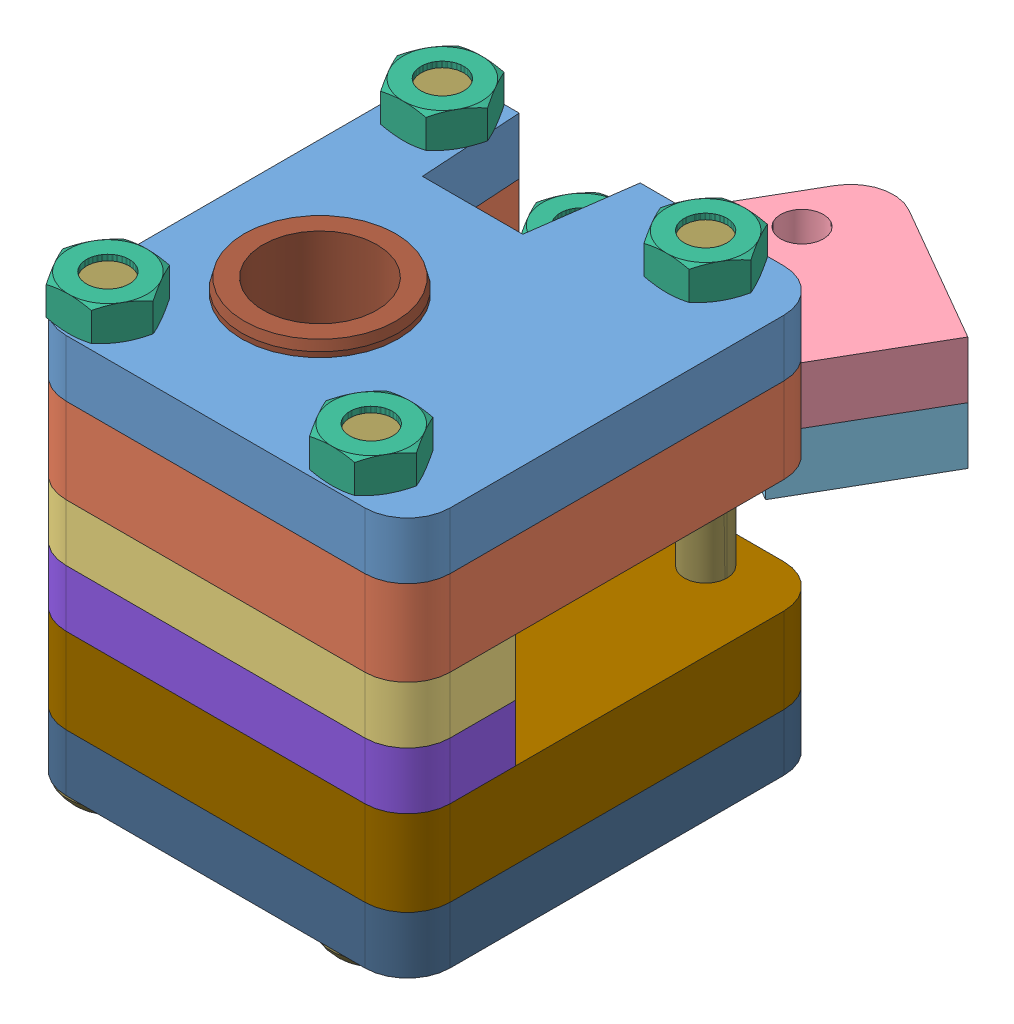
SolidWorks assembly UM_3050_ASM.sldasm, configuration Default (file format 5000). Lengths in mm.
Overall size (31.9 32.3 48.73).
23 component instances, 12 part files, 0 mates.
Components (placement in the parent):
- UM_3051-1: UM_3051.sldprt [Default] at origin size (27 4 29.45)
- UM_3052-1: UM_3052.sldprt [Default] at (0 -5 0) size (27 6 29.45)
- UM_3053-1: UM_3053.sldprt [Default] at (0 -10 0) size (31.9 4.01 19.37)
- UM_3060_ASM-1: UM_3060_ASM.sldasm [Default] at (4.2791 -10 -13.8732) x (0.5 0 -0.866025) z (0.866025 0 0.5) size (27 19.5 14.3)
  - UM_3061-1: UM_3061.sldprt [Default] at origin size (27 4 14.3)
  - UM_3062-1: UM_3062.sldprt [Default] at (0 -4 0) size (27 4 14.3)
  - DIN934_M3-1: DIN934_M3.sldprt [Default] at (-3.05 -8.4 -8.125) x (-1 0 0) z (0 1 0) size (6.35 5.5 2.4)
  - DIN934_M3-2: DIN934_M3.sldprt [Default] at (-3.05 -10.8 -8.125) x (-1 0 0) z (0 1 0) size (6.35 5.5 2.4)
  - DIN934_M3-3: DIN934_M3.sldprt [Default] at (-3.05 4.4 -8.125) x (1 0 0) z (0 -1 0) size (6.35 5.5 2.4)
  - DIN934_M3-4: DIN934_M3.sldprt [Default] at (-3.05 6.8 -8.125) x (1 0 0) z (0 -1 0) size (6.35 5.5 2.4)
  - ISO7380_M3X16-1: ISO7380_M3X16.sldprt [Default] at (-3.05 -10.8 -8.125) x (-1 0 0) z (0 0 1) size (5.77 17.9 5.75)
- UM_3055-1: UM_3055.sldprt [Default] at (0 -14 0) size (31.9 4.01 19.37)
- UM_3057-1: UM_3057.sldprt [Default] at (0 -19 0) size (27 6 29.45)
- UM_3058-1: UM_3058.sldprt [Default] at (0 -24 0) size (27 4 29.45)
- SLIDE_BEARING_8X11X30-1: SLIDE_BEARING_8X11X30.sldprt [Default] at (-4.1 -12 3.275) x (0 1 0) z (0 0 1) size (30 11 11)
- ISO7380_M3X30-1: ISO7380_M3X30.sldprt [Default] at (-10.5 -26 11.775) x (-1 0 0) z (0 0 1) size (5.77 31.9 5.75)
- ISO7380_M3X30-2: ISO7380_M3X30.sldprt [Default] at (8 -26 11.775) x (-1 0 0) z (0 0 1) size (5.77 31.9 5.75)
- DIN934_M3-1: DIN934_M3.sldprt [Default] at (8 4.4 11.775) x (1 0 0) z (0 -1 0) size (6.35 5.5 2.4)
- DIN934_M3-2: DIN934_M3.sldprt [Default] at (-10.5 4.4 11.775) x (1 0 0) z (0 -1 0) size (6.35 5.5 2.4)
- ISO7380_M3X30-3: ISO7380_M3X30.sldprt [Default] at (-10.5 -26 -11.725) x (-1 0 0) z (0 0 1) size (5.77 31.9 5.75)
- DIN934_M3-3: DIN934_M3.sldprt [Default] at (-10.5 4.4 -11.725) x (1 0 0) z (0 -1 0) size (6.35 5.5 2.4)
- ISO7380_M3X30-4: ISO7380_M3X30.sldprt [Default] at (8 -26 -11.725) x (-1 0 0) z (0 0 1) size (5.77 31.9 5.75)
- DIN934_M3-4: DIN934_M3.sldprt [Default] at (8 4.4 -11.725) x (1 0 0) z (0 -1 0) size (6.35 5.5 2.4)
